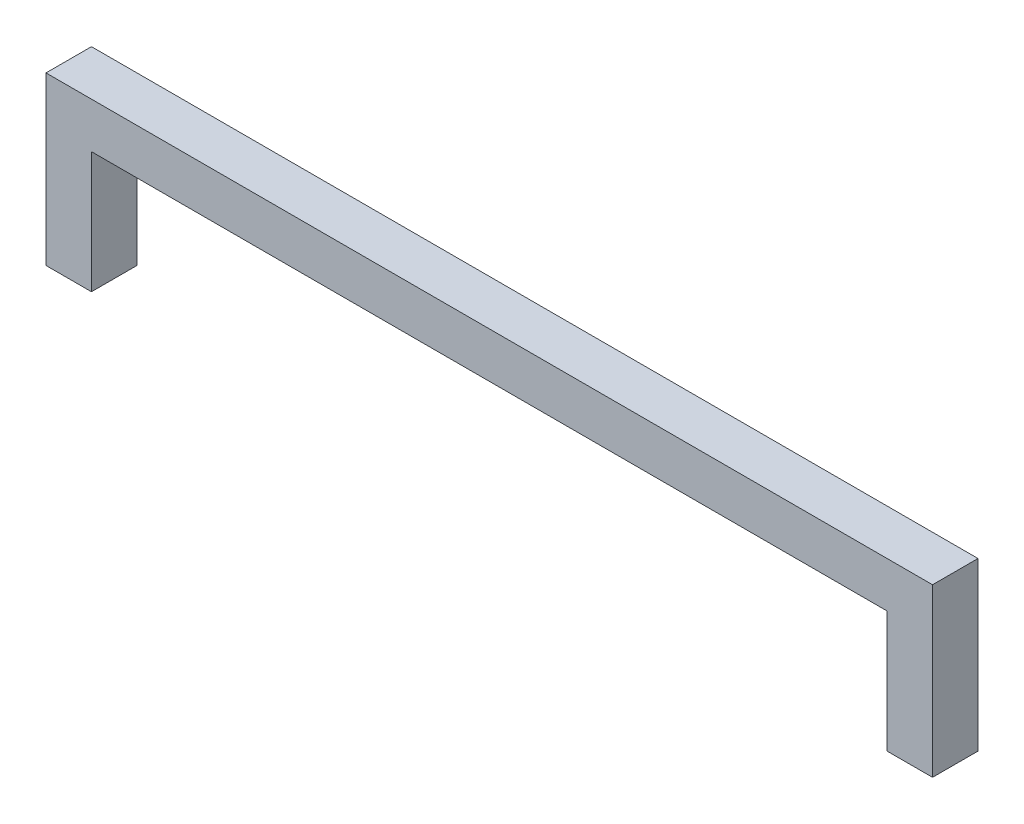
ISO-10303-21;
HEADER;
FILE_DESCRIPTION(('STEP AP214'),'2;1');
FILE_NAME('part.step','',(''),(''),'','','');
FILE_SCHEMA(('AUTOMOTIVE_DESIGN { 1 0 10303 214 1 1 1 1 }'));
ENDSEC;
DATA;
#1=APPLICATION_CONTEXT('core data for automotive mechanical design processes');
#2=APPLICATION_PROTOCOL_DEFINITION('international standard','automotive_design',2000,#1);
#3=PRODUCT_CONTEXT('',#1,'mechanical');
#4=PRODUCT('Part','Part','',(#3));
#5=PRODUCT_RELATED_PRODUCT_CATEGORY('part','',(#4));
#6=PRODUCT_DEFINITION_FORMATION('','',#4);
#7=PRODUCT_DEFINITION_CONTEXT('part definition',#1,'design');
#8=PRODUCT_DEFINITION('design','',#6,#7);
#9=PRODUCT_DEFINITION_SHAPE('','',#8);
#10=(LENGTH_UNIT() NAMED_UNIT(*) SI_UNIT(.MILLI.,.METRE.));
#11=(NAMED_UNIT(*) PLANE_ANGLE_UNIT() SI_UNIT($,.RADIAN.));
#12=(NAMED_UNIT(*) SI_UNIT($,.STERADIAN.) SOLID_ANGLE_UNIT());
#13=UNCERTAINTY_MEASURE_WITH_UNIT(LENGTH_MEASURE(1.E-05),#10,'distance_accuracy_value','');
#14=(GEOMETRIC_REPRESENTATION_CONTEXT(3) GLOBAL_UNCERTAINTY_ASSIGNED_CONTEXT((#13)) GLOBAL_UNIT_ASSIGNED_CONTEXT((#10,
#11,#12)) REPRESENTATION_CONTEXT('',''));
#15=CARTESIAN_POINT('',(0.,0.,0.));
#16=DIRECTION('',(0.,0.,1.));
#17=DIRECTION('',(1.,0.,0.));
#18=AXIS2_PLACEMENT_3D('',#15,#16,#17);
#19=CARTESIAN_POINT('',(700.,0.,0.));
#20=DIRECTION('',(0.,1.,0.));
#21=DIRECTION('',(0.,0.,-1.));
#22=AXIS2_PLACEMENT_3D('',#19,#20,#21);
#23=PLANE('',#22);
#24=DIRECTION('',(0.,0.,-1.));
#25=VECTOR('',#24,1.);
#26=CARTESIAN_POINT('',(700.,0.,0.));
#27=LINE('',#26,#25);
#28=CARTESIAN_POINT('',(700.,0.,40.));
#29=VERTEX_POINT('',#28);
#30=CARTESIAN_POINT('',(700.,0.,0.));
#31=VERTEX_POINT('',#30);
#32=EDGE_CURVE('E260',#29,#31,#27,.T.);
#33=ORIENTED_EDGE('',*,*,#32,.T.);
#34=DIRECTION('',(1.,0.,0.));
#35=VECTOR('',#34,1.);
#36=CARTESIAN_POINT('',(700.,0.,0.));
#37=LINE('',#36,#35);
#38=CARTESIAN_POINT('',(740.,0.,0.));
#39=VERTEX_POINT('',#38);
#40=EDGE_CURVE('E258',#31,#39,#37,.T.);
#41=ORIENTED_EDGE('',*,*,#40,.T.);
#42=DIRECTION('',(0.,0.,1.));
#43=VECTOR('',#42,1.);
#44=CARTESIAN_POINT('',(740.,0.,0.));
#45=LINE('',#44,#43);
#46=CARTESIAN_POINT('',(740.,0.,40.));
#47=VERTEX_POINT('',#46);
#48=EDGE_CURVE('E264',#39,#47,#45,.T.);
#49=ORIENTED_EDGE('',*,*,#48,.T.);
#50=DIRECTION('',(-1.,0.,0.));
#51=VECTOR('',#50,1.);
#52=CARTESIAN_POINT('',(700.,0.,40.));
#53=LINE('',#52,#51);
#54=EDGE_CURVE('E262',#47,#29,#53,.T.);
#55=ORIENTED_EDGE('',*,*,#54,.T.);
#56=EDGE_LOOP('',(#33,#41,#49,#55));
#57=FACE_BOUND('',#56,.T.);
#58=DIRECTION('',(0.,0.,-1.));
#59=VECTOR('',#58,1.);
#60=CARTESIAN_POINT('',(701.,0.,0.));
#61=LINE('',#60,#59);
#62=CARTESIAN_POINT('',(701.,0.,39.));
#63=VERTEX_POINT('',#62);
#64=CARTESIAN_POINT('',(701.,0.,1.));
#65=VERTEX_POINT('',#64);
#66=EDGE_CURVE('E199',#63,#65,#61,.T.);
#67=ORIENTED_EDGE('',*,*,#66,.F.);
#68=DIRECTION('',(-1.,0.,0.));
#69=VECTOR('',#68,1.);
#70=CARTESIAN_POINT('',(700.,0.,39.));
#71=LINE('',#70,#69);
#72=CARTESIAN_POINT('',(739.,0.,39.));
#73=VERTEX_POINT('',#72);
#74=EDGE_CURVE('E197',#73,#63,#71,.T.);
#75=ORIENTED_EDGE('',*,*,#74,.F.);
#76=DIRECTION('',(0.,0.,1.));
#77=VECTOR('',#76,1.);
#78=CARTESIAN_POINT('',(739.,0.,0.));
#79=LINE('',#78,#77);
#80=CARTESIAN_POINT('',(739.,0.,1.));
#81=VERTEX_POINT('',#80);
#82=EDGE_CURVE('E167',#81,#73,#79,.T.);
#83=ORIENTED_EDGE('',*,*,#82,.F.);
#84=DIRECTION('',(1.,0.,0.));
#85=VECTOR('',#84,1.);
#86=CARTESIAN_POINT('',(700.,0.,1.));
#87=LINE('',#86,#85);
#88=EDGE_CURVE('E201',#65,#81,#87,.T.);
#89=ORIENTED_EDGE('',*,*,#88,.F.);
#90=EDGE_LOOP('',(#67,#75,#83,#89));
#91=FACE_BOUND('',#90,.T.);
#92=ADVANCED_FACE('F39',(#57,#91),#23,.F.);
#93=CARTESIAN_POINT('',(0.,0.,0.));
#94=DIRECTION('',(0.,-1.,0.));
#95=DIRECTION('',(0.,0.,-1.));
#96=AXIS2_PLACEMENT_3D('',#93,#94,#95);
#97=PLANE('',#96);
#98=DIRECTION('',(0.,0.,-1.));
#99=VECTOR('',#98,1.);
#100=CARTESIAN_POINT('',(0.,0.,0.));
#101=LINE('',#100,#99);
#102=CARTESIAN_POINT('',(0.,0.,40.));
#103=VERTEX_POINT('',#102);
#104=CARTESIAN_POINT('',(0.,0.,0.));
#105=VERTEX_POINT('',#104);
#106=EDGE_CURVE('E229',#103,#105,#101,.T.);
#107=ORIENTED_EDGE('',*,*,#106,.F.);
#108=DIRECTION('',(1.,0.,0.));
#109=VECTOR('',#108,1.);
#110=CARTESIAN_POINT('',(0.,0.,40.));
#111=LINE('',#110,#109);
#112=CARTESIAN_POINT('',(-40.,0.,40.));
#113=VERTEX_POINT('',#112);
#114=EDGE_CURVE('E217',#113,#103,#111,.T.);
#115=ORIENTED_EDGE('',*,*,#114,.F.);
#116=DIRECTION('',(0.,0.,1.));
#117=VECTOR('',#116,1.);
#118=CARTESIAN_POINT('',(-40.,0.,0.));
#119=LINE('',#118,#117);
#120=CARTESIAN_POINT('',(-40.,0.,0.));
#121=VERTEX_POINT('',#120);
#122=EDGE_CURVE('E214',#121,#113,#119,.T.);
#123=ORIENTED_EDGE('',*,*,#122,.F.);
#124=DIRECTION('',(-1.,0.,0.));
#125=VECTOR('',#124,1.);
#126=CARTESIAN_POINT('',(0.,0.,0.));
#127=LINE('',#126,#125);
#128=EDGE_CURVE('E226',#105,#121,#127,.T.);
#129=ORIENTED_EDGE('',*,*,#128,.F.);
#130=EDGE_LOOP('',(#107,#115,#123,#129));
#131=FACE_BOUND('',#130,.T.);
#132=DIRECTION('',(1.,0.,0.));
#133=VECTOR('',#132,1.);
#134=CARTESIAN_POINT('',(0.,0.,39.));
#135=LINE('',#134,#133);
#136=CARTESIAN_POINT('',(-39.,0.,39.));
#137=VERTEX_POINT('',#136);
#138=CARTESIAN_POINT('',(-1.,0.,39.));
#139=VERTEX_POINT('',#138);
#140=EDGE_CURVE('E208',#137,#139,#135,.T.);
#141=ORIENTED_EDGE('',*,*,#140,.T.);
#142=DIRECTION('',(0.,0.,-1.));
#143=VECTOR('',#142,1.);
#144=CARTESIAN_POINT('',(-1.,0.,0.));
#145=LINE('',#144,#143);
#146=CARTESIAN_POINT('',(-1.,0.,1.));
#147=VERTEX_POINT('',#146);
#148=EDGE_CURVE('E205',#139,#147,#145,.T.);
#149=ORIENTED_EDGE('',*,*,#148,.T.);
#150=DIRECTION('',(-1.,0.,0.));
#151=VECTOR('',#150,1.);
#152=CARTESIAN_POINT('',(0.,0.,1.));
#153=LINE('',#152,#151);
#154=CARTESIAN_POINT('',(-39.,0.,1.));
#155=VERTEX_POINT('',#154);
#156=EDGE_CURVE('E188',#147,#155,#153,.T.);
#157=ORIENTED_EDGE('',*,*,#156,.T.);
#158=DIRECTION('',(0.,0.,1.));
#159=VECTOR('',#158,1.);
#160=CARTESIAN_POINT('',(-39.,0.,0.));
#161=LINE('',#160,#159);
#162=EDGE_CURVE('E211',#155,#137,#161,.T.);
#163=ORIENTED_EDGE('',*,*,#162,.T.);
#164=EDGE_LOOP('',(#141,#149,#157,#163));
#165=FACE_BOUND('',#164,.T.);
#166=ADVANCED_FACE('F293',(#131,#165),#97,.T.);
#167=CARTESIAN_POINT('',(740.,150.87,0.));
#168=DIRECTION('',(1.,0.,0.));
#169=DIRECTION('',(0.,0.,-1.));
#170=AXIS2_PLACEMENT_3D('',#167,#168,#169);
#171=PLANE('',#170);
#172=DIRECTION('',(0.,0.,-1.));
#173=VECTOR('',#172,1.);
#174=CARTESIAN_POINT('',(740.,146.77,-1.31427935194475E-13));
#175=LINE('',#174,#173);
#176=CARTESIAN_POINT('',(740.,146.77,40.));
#177=VERTEX_POINT('',#176);
#178=CARTESIAN_POINT('',(740.,146.77,0.));
#179=VERTEX_POINT('',#178);
#180=EDGE_CURVE('E243',#177,#179,#175,.T.);
#181=ORIENTED_EDGE('',*,*,#180,.F.);
#182=DIRECTION('',(0.,-1.,0.));
#183=VECTOR('',#182,1.);
#184=CARTESIAN_POINT('',(740.,150.87,40.));
#185=LINE('',#184,#183);
#186=EDGE_CURVE('E271',#177,#47,#185,.T.);
#187=ORIENTED_EDGE('',*,*,#186,.T.);
#188=ORIENTED_EDGE('',*,*,#48,.F.);
#189=DIRECTION('',(0.,-1.,0.));
#190=VECTOR('',#189,1.);
#191=CARTESIAN_POINT('',(740.,150.87,0.));
#192=LINE('',#191,#190);
#193=EDGE_CURVE('E42',#179,#39,#192,.T.);
#194=ORIENTED_EDGE('',*,*,#193,.F.);
#195=EDGE_LOOP('',(#181,#187,#188,#194));
#196=FACE_BOUND('',#195,.T.);
#197=ADVANCED_FACE('F281',(#196),#171,.T.);
#198=CARTESIAN_POINT('',(700.,150.87,0.));
#199=DIRECTION('',(-1.,0.,0.));
#200=DIRECTION('',(0.,0.,1.));
#201=AXIS2_PLACEMENT_3D('',#198,#199,#200);
#202=PLANE('',#201);
#203=DIRECTION('',(0.,0.,1.));
#204=VECTOR('',#203,1.);
#205=CARTESIAN_POINT('',(700.,106.77,0.));
#206=LINE('',#205,#204);
#207=CARTESIAN_POINT('',(700.,106.77,0.));
#208=VERTEX_POINT('',#207);
#209=CARTESIAN_POINT('',(700.,106.77,40.));
#210=VERTEX_POINT('',#209);
#211=EDGE_CURVE('E218',#208,#210,#206,.T.);
#212=ORIENTED_EDGE('',*,*,#211,.F.);
#213=DIRECTION('',(0.,-1.,0.));
#214=VECTOR('',#213,1.);
#215=CARTESIAN_POINT('',(700.,150.87,0.));
#216=LINE('',#215,#214);
#217=EDGE_CURVE('E266',#208,#31,#216,.T.);
#218=ORIENTED_EDGE('',*,*,#217,.T.);
#219=ORIENTED_EDGE('',*,*,#32,.F.);
#220=DIRECTION('',(0.,-1.,0.));
#221=VECTOR('',#220,1.);
#222=CARTESIAN_POINT('',(700.,150.87,40.));
#223=LINE('',#222,#221);
#224=EDGE_CURVE('E269',#210,#29,#223,.T.);
#225=ORIENTED_EDGE('',*,*,#224,.F.);
#226=EDGE_LOOP('',(#212,#218,#219,#225));
#227=FACE_BOUND('',#226,.T.);
#228=ADVANCED_FACE('F303',(#227),#202,.T.);
#229=CARTESIAN_POINT('',(-44.1,106.77,0.));
#230=DIRECTION('',(0.,-1.,0.));
#231=DIRECTION('',(0.,0.,-1.));
#232=AXIS2_PLACEMENT_3D('',#229,#230,#231);
#233=PLANE('',#232);
#234=DIRECTION('',(1.,0.,0.));
#235=VECTOR('',#234,1.);
#236=CARTESIAN_POINT('',(-44.1,106.77,0.));
#237=LINE('',#236,#235);
#238=CARTESIAN_POINT('',(0.,106.77,0.));
#239=VERTEX_POINT('',#238);
#240=EDGE_CURVE('E244',#239,#208,#237,.T.);
#241=ORIENTED_EDGE('',*,*,#240,.T.);
#242=ORIENTED_EDGE('',*,*,#211,.T.);
#243=DIRECTION('',(1.,0.,0.));
#244=VECTOR('',#243,1.);
#245=CARTESIAN_POINT('',(-44.1,106.77,40.));
#246=LINE('',#245,#244);
#247=CARTESIAN_POINT('',(0.,106.77,40.));
#248=VERTEX_POINT('',#247);
#249=EDGE_CURVE('E247',#248,#210,#246,.T.);
#250=ORIENTED_EDGE('',*,*,#249,.F.);
#251=DIRECTION('',(0.,0.,1.));
#252=VECTOR('',#251,1.);
#253=CARTESIAN_POINT('',(0.,106.77,0.));
#254=LINE('',#253,#252);
#255=EDGE_CURVE('E11',#239,#248,#254,.T.);
#256=ORIENTED_EDGE('',*,*,#255,.F.);
#257=EDGE_LOOP('',(#241,#242,#250,#256));
#258=FACE_BOUND('',#257,.T.);
#259=ADVANCED_FACE('F301',(#258),#233,.T.);
#260=CARTESIAN_POINT('',(-44.1,146.77,0.));
#261=DIRECTION('',(0.,1.,0.));
#262=DIRECTION('',(0.,0.,1.));
#263=AXIS2_PLACEMENT_3D('',#260,#261,#262);
#264=PLANE('',#263);
#265=DIRECTION('',(1.,0.,0.));
#266=VECTOR('',#265,1.);
#267=CARTESIAN_POINT('',(-44.1,146.77,40.));
#268=LINE('',#267,#266);
#269=CARTESIAN_POINT('',(-40.,146.77,40.));
#270=VERTEX_POINT('',#269);
#271=EDGE_CURVE('E250',#270,#177,#268,.T.);
#272=ORIENTED_EDGE('',*,*,#271,.T.);
#273=ORIENTED_EDGE('',*,*,#180,.T.);
#274=DIRECTION('',(1.,0.,0.));
#275=VECTOR('',#274,1.);
#276=CARTESIAN_POINT('',(-44.1,146.77,0.));
#277=LINE('',#276,#275);
#278=CARTESIAN_POINT('',(-40.,146.77,0.));
#279=VERTEX_POINT('',#278);
#280=EDGE_CURVE('E253',#279,#179,#277,.T.);
#281=ORIENTED_EDGE('',*,*,#280,.F.);
#282=DIRECTION('',(0.,0.,-1.));
#283=VECTOR('',#282,1.);
#284=CARTESIAN_POINT('',(-40.,146.77,0.));
#285=LINE('',#284,#283);
#286=EDGE_CURVE('E47',#270,#279,#285,.T.);
#287=ORIENTED_EDGE('',*,*,#286,.F.);
#288=EDGE_LOOP('',(#272,#273,#281,#287));
#289=FACE_BOUND('',#288,.T.);
#290=ADVANCED_FACE('F283',(#289),#264,.T.);
#291=CARTESIAN_POINT('',(0.,0.,0.));
#292=DIRECTION('',(0.,0.,-1.));
#293=DIRECTION('',(-1.,0.,0.));
#294=AXIS2_PLACEMENT_3D('',#291,#292,#293);
#295=PLANE('',#294);
#296=DIRECTION('',(0.,1.,0.));
#297=VECTOR('',#296,1.);
#298=CARTESIAN_POINT('',(-40.,0.,0.));
#299=LINE('',#298,#297);
#300=EDGE_CURVE('E223',#121,#279,#299,.T.);
#301=ORIENTED_EDGE('',*,*,#300,.T.);
#302=ORIENTED_EDGE('',*,*,#280,.T.);
#303=ORIENTED_EDGE('',*,*,#193,.T.);
#304=ORIENTED_EDGE('',*,*,#40,.F.);
#305=ORIENTED_EDGE('',*,*,#217,.F.);
#306=ORIENTED_EDGE('',*,*,#240,.F.);
#307=DIRECTION('',(0.,1.,0.));
#308=VECTOR('',#307,1.);
#309=CARTESIAN_POINT('',(0.,0.,0.));
#310=LINE('',#309,#308);
#311=EDGE_CURVE('E232',#105,#239,#310,.T.);
#312=ORIENTED_EDGE('',*,*,#311,.F.);
#313=ORIENTED_EDGE('',*,*,#128,.T.);
#314=EDGE_LOOP('',(#301,#302,#303,#304,#305,#306,#312,#313));
#315=FACE_BOUND('',#314,.T.);
#316=ADVANCED_FACE('F279',(#315),#295,.T.);
#317=CARTESIAN_POINT('',(0.,0.,0.));
#318=DIRECTION('',(1.,0.,0.));
#319=DIRECTION('',(0.,0.,-1.));
#320=AXIS2_PLACEMENT_3D('',#317,#318,#319);
#321=PLANE('',#320);
#322=ORIENTED_EDGE('',*,*,#311,.T.);
#323=ORIENTED_EDGE('',*,*,#255,.T.);
#324=DIRECTION('',(0.,1.,0.));
#325=VECTOR('',#324,1.);
#326=CARTESIAN_POINT('',(0.,0.,40.));
#327=LINE('',#326,#325);
#328=EDGE_CURVE('E222',#103,#248,#327,.T.);
#329=ORIENTED_EDGE('',*,*,#328,.F.);
#330=ORIENTED_EDGE('',*,*,#106,.T.);
#331=EDGE_LOOP('',(#322,#323,#329,#330));
#332=FACE_BOUND('',#331,.T.);
#333=ADVANCED_FACE('F298',(#332),#321,.T.);
#334=CARTESIAN_POINT('',(0.,0.,40.));
#335=DIRECTION('',(0.,0.,1.));
#336=DIRECTION('',(1.,0.,0.));
#337=AXIS2_PLACEMENT_3D('',#334,#335,#336);
#338=PLANE('',#337);
#339=ORIENTED_EDGE('',*,*,#328,.T.);
#340=ORIENTED_EDGE('',*,*,#249,.T.);
#341=ORIENTED_EDGE('',*,*,#224,.T.);
#342=ORIENTED_EDGE('',*,*,#54,.F.);
#343=ORIENTED_EDGE('',*,*,#186,.F.);
#344=ORIENTED_EDGE('',*,*,#271,.F.);
#345=DIRECTION('',(0.,1.,0.));
#346=VECTOR('',#345,1.);
#347=CARTESIAN_POINT('',(-40.,0.,40.));
#348=LINE('',#347,#346);
#349=EDGE_CURVE('E219',#113,#270,#348,.T.);
#350=ORIENTED_EDGE('',*,*,#349,.F.);
#351=ORIENTED_EDGE('',*,*,#114,.T.);
#352=EDGE_LOOP('',(#339,#340,#341,#342,#343,#344,#350,#351));
#353=FACE_BOUND('',#352,.T.);
#354=ADVANCED_FACE('F287',(#353),#338,.T.);
#355=CARTESIAN_POINT('',(-40.,0.,0.));
#356=DIRECTION('',(-1.,0.,0.));
#357=DIRECTION('',(0.,0.,1.));
#358=AXIS2_PLACEMENT_3D('',#355,#356,#357);
#359=PLANE('',#358);
#360=ORIENTED_EDGE('',*,*,#349,.T.);
#361=ORIENTED_EDGE('',*,*,#286,.T.);
#362=ORIENTED_EDGE('',*,*,#300,.F.);
#363=ORIENTED_EDGE('',*,*,#122,.T.);
#364=EDGE_LOOP('',(#360,#361,#362,#363));
#365=FACE_BOUND('',#364,.T.);
#366=ADVANCED_FACE('F290',(#365),#359,.T.);
#367=CARTESIAN_POINT('',(739.,150.87,0.));
#368=DIRECTION('',(1.,0.,0.));
#369=DIRECTION('',(0.,0.,-1.));
#370=AXIS2_PLACEMENT_3D('',#367,#368,#369);
#371=PLANE('',#370);
#372=DIRECTION('',(0.,0.,-1.));
#373=VECTOR('',#372,1.);
#374=CARTESIAN_POINT('',(739.,145.77,-1.3108099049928E-13));
#375=LINE('',#374,#373);
#376=CARTESIAN_POINT('',(739.,145.77,39.));
#377=VERTEX_POINT('',#376);
#378=CARTESIAN_POINT('',(739.,145.77,1.));
#379=VERTEX_POINT('',#378);
#380=EDGE_CURVE('E155',#377,#379,#375,.T.);
#381=ORIENTED_EDGE('',*,*,#380,.T.);
#382=DIRECTION('',(0.,-1.,0.));
#383=VECTOR('',#382,1.);
#384=CARTESIAN_POINT('',(739.,150.87,1.));
#385=LINE('',#384,#383);
#386=EDGE_CURVE('E169',#379,#81,#385,.T.);
#387=ORIENTED_EDGE('',*,*,#386,.T.);
#388=ORIENTED_EDGE('',*,*,#82,.T.);
#389=DIRECTION('',(0.,-1.,0.));
#390=VECTOR('',#389,1.);
#391=CARTESIAN_POINT('',(739.,150.87,39.));
#392=LINE('',#391,#390);
#393=EDGE_CURVE('E55',#377,#73,#392,.T.);
#394=ORIENTED_EDGE('',*,*,#393,.F.);
#395=EDGE_LOOP('',(#381,#387,#388,#394));
#396=FACE_BOUND('',#395,.T.);
#397=ADVANCED_FACE('F165',(#396),#371,.F.);
#398=CARTESIAN_POINT('',(700.,150.87,39.));
#399=DIRECTION('',(0.,0.,1.));
#400=DIRECTION('',(1.,0.,0.));
#401=AXIS2_PLACEMENT_3D('',#398,#399,#400);
#402=PLANE('',#401);
#403=DIRECTION('',(0.,-1.,0.));
#404=VECTOR('',#403,1.);
#405=CARTESIAN_POINT('',(701.,150.87,39.));
#406=LINE('',#405,#404);
#407=CARTESIAN_POINT('',(701.,107.77,39.));
#408=VERTEX_POINT('',#407);
#409=EDGE_CURVE('E170',#408,#63,#406,.T.);
#410=ORIENTED_EDGE('',*,*,#409,.F.);
#411=DIRECTION('',(1.,0.,0.));
#412=VECTOR('',#411,1.);
#413=CARTESIAN_POINT('',(-44.1,107.77,39.));
#414=LINE('',#413,#412);
#415=CARTESIAN_POINT('',(-0.999999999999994,107.77,39.));
#416=VERTEX_POINT('',#415);
#417=EDGE_CURVE('E175',#416,#408,#414,.T.);
#418=ORIENTED_EDGE('',*,*,#417,.F.);
#419=DIRECTION('',(0.,1.,0.));
#420=VECTOR('',#419,1.);
#421=CARTESIAN_POINT('',(-1.,0.,39.));
#422=LINE('',#421,#420);
#423=EDGE_CURVE('E191',#139,#416,#422,.T.);
#424=ORIENTED_EDGE('',*,*,#423,.F.);
#425=ORIENTED_EDGE('',*,*,#140,.F.);
#426=DIRECTION('',(0.,1.,0.));
#427=VECTOR('',#426,1.);
#428=CARTESIAN_POINT('',(-39.,0.,39.));
#429=LINE('',#428,#427);
#430=CARTESIAN_POINT('',(-39.,145.77,39.));
#431=VERTEX_POINT('',#430);
#432=EDGE_CURVE('E174',#137,#431,#429,.T.);
#433=ORIENTED_EDGE('',*,*,#432,.T.);
#434=DIRECTION('',(1.,0.,0.));
#435=VECTOR('',#434,1.);
#436=CARTESIAN_POINT('',(-44.1,145.77,39.));
#437=LINE('',#436,#435);
#438=EDGE_CURVE('E158',#431,#377,#437,.T.);
#439=ORIENTED_EDGE('',*,*,#438,.T.);
#440=ORIENTED_EDGE('',*,*,#393,.T.);
#441=ORIENTED_EDGE('',*,*,#74,.T.);
#442=EDGE_LOOP('',(#410,#418,#424,#425,#433,#439,#440,#441));
#443=FACE_BOUND('',#442,.T.);
#444=ADVANCED_FACE('F172',(#443),#402,.F.);
#445=CARTESIAN_POINT('',(701.,150.87,0.));
#446=DIRECTION('',(-1.,0.,0.));
#447=DIRECTION('',(0.,0.,1.));
#448=AXIS2_PLACEMENT_3D('',#445,#446,#447);
#449=PLANE('',#448);
#450=DIRECTION('',(0.,0.,1.));
#451=VECTOR('',#450,1.);
#452=CARTESIAN_POINT('',(701.,107.77,0.));
#453=LINE('',#452,#451);
#454=CARTESIAN_POINT('',(701.,107.77,1.));
#455=VERTEX_POINT('',#454);
#456=EDGE_CURVE('E163',#455,#408,#453,.T.);
#457=ORIENTED_EDGE('',*,*,#456,.T.);
#458=ORIENTED_EDGE('',*,*,#409,.T.);
#459=ORIENTED_EDGE('',*,*,#66,.T.);
#460=DIRECTION('',(0.,-1.,0.));
#461=VECTOR('',#460,1.);
#462=CARTESIAN_POINT('',(701.,150.87,1.));
#463=LINE('',#462,#461);
#464=EDGE_CURVE('E196',#455,#65,#463,.T.);
#465=ORIENTED_EDGE('',*,*,#464,.F.);
#466=EDGE_LOOP('',(#457,#458,#459,#465));
#467=FACE_BOUND('',#466,.T.);
#468=ADVANCED_FACE('F315',(#467),#449,.F.);
#469=CARTESIAN_POINT('',(700.,150.87,1.));
#470=DIRECTION('',(0.,0.,-1.));
#471=DIRECTION('',(-1.,0.,0.));
#472=AXIS2_PLACEMENT_3D('',#469,#470,#471);
#473=PLANE('',#472);
#474=ORIENTED_EDGE('',*,*,#386,.F.);
#475=DIRECTION('',(1.,0.,0.));
#476=VECTOR('',#475,1.);
#477=CARTESIAN_POINT('',(-44.1,145.77,1.));
#478=LINE('',#477,#476);
#479=CARTESIAN_POINT('',(-39.,145.77,1.));
#480=VERTEX_POINT('',#479);
#481=EDGE_CURVE('E160',#480,#379,#478,.T.);
#482=ORIENTED_EDGE('',*,*,#481,.F.);
#483=DIRECTION('',(0.,1.,0.));
#484=VECTOR('',#483,1.);
#485=CARTESIAN_POINT('',(-39.,0.,1.));
#486=LINE('',#485,#484);
#487=EDGE_CURVE('E63',#155,#480,#486,.T.);
#488=ORIENTED_EDGE('',*,*,#487,.F.);
#489=ORIENTED_EDGE('',*,*,#156,.F.);
#490=DIRECTION('',(0.,1.,0.));
#491=VECTOR('',#490,1.);
#492=CARTESIAN_POINT('',(-1.,0.,1.));
#493=LINE('',#492,#491);
#494=CARTESIAN_POINT('',(-0.999999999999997,107.77,1.));
#495=VERTEX_POINT('',#494);
#496=EDGE_CURVE('E186',#147,#495,#493,.T.);
#497=ORIENTED_EDGE('',*,*,#496,.T.);
#498=DIRECTION('',(1.,0.,0.));
#499=VECTOR('',#498,1.);
#500=CARTESIAN_POINT('',(-44.1,107.77,1.));
#501=LINE('',#500,#499);
#502=EDGE_CURVE('E179',#495,#455,#501,.T.);
#503=ORIENTED_EDGE('',*,*,#502,.T.);
#504=ORIENTED_EDGE('',*,*,#464,.T.);
#505=ORIENTED_EDGE('',*,*,#88,.T.);
#506=EDGE_LOOP('',(#474,#482,#488,#489,#497,#503,#504,#505));
#507=FACE_BOUND('',#506,.T.);
#508=ADVANCED_FACE('F317',(#507),#473,.F.);
#509=CARTESIAN_POINT('',(-44.1,107.77,0.));
#510=DIRECTION('',(0.,-1.,0.));
#511=DIRECTION('',(0.,0.,-1.));
#512=AXIS2_PLACEMENT_3D('',#509,#510,#511);
#513=PLANE('',#512);
#514=ORIENTED_EDGE('',*,*,#502,.F.);
#515=DIRECTION('',(0.,0.,1.));
#516=VECTOR('',#515,1.);
#517=CARTESIAN_POINT('',(-1.,107.77,0.));
#518=LINE('',#517,#516);
#519=EDGE_CURVE('E183',#495,#416,#518,.T.);
#520=ORIENTED_EDGE('',*,*,#519,.T.);
#521=ORIENTED_EDGE('',*,*,#417,.T.);
#522=ORIENTED_EDGE('',*,*,#456,.F.);
#523=EDGE_LOOP('',(#514,#520,#521,#522));
#524=FACE_BOUND('',#523,.T.);
#525=ADVANCED_FACE('F332',(#524),#513,.F.);
#526=CARTESIAN_POINT('',(-44.1,145.77,0.));
#527=DIRECTION('',(0.,1.,0.));
#528=DIRECTION('',(0.,0.,1.));
#529=AXIS2_PLACEMENT_3D('',#526,#527,#528);
#530=PLANE('',#529);
#531=ORIENTED_EDGE('',*,*,#438,.F.);
#532=DIRECTION('',(0.,0.,-1.));
#533=VECTOR('',#532,1.);
#534=CARTESIAN_POINT('',(-39.,145.77,0.));
#535=LINE('',#534,#533);
#536=EDGE_CURVE('E184',#431,#480,#535,.T.);
#537=ORIENTED_EDGE('',*,*,#536,.T.);
#538=ORIENTED_EDGE('',*,*,#481,.T.);
#539=ORIENTED_EDGE('',*,*,#380,.F.);
#540=EDGE_LOOP('',(#531,#537,#538,#539));
#541=FACE_BOUND('',#540,.T.);
#542=ADVANCED_FACE('F156',(#541),#530,.F.);
#543=CARTESIAN_POINT('',(-1.,0.,0.));
#544=DIRECTION('',(1.,0.,0.));
#545=DIRECTION('',(0.,0.,-1.));
#546=AXIS2_PLACEMENT_3D('',#543,#544,#545);
#547=PLANE('',#546);
#548=ORIENTED_EDGE('',*,*,#496,.F.);
#549=ORIENTED_EDGE('',*,*,#148,.F.);
#550=ORIENTED_EDGE('',*,*,#423,.T.);
#551=ORIENTED_EDGE('',*,*,#519,.F.);
#552=EDGE_LOOP('',(#548,#549,#550,#551));
#553=FACE_BOUND('',#552,.T.);
#554=ADVANCED_FACE('F328',(#553),#547,.F.);
#555=CARTESIAN_POINT('',(-39.,0.,0.));
#556=DIRECTION('',(-1.,0.,0.));
#557=DIRECTION('',(0.,0.,1.));
#558=AXIS2_PLACEMENT_3D('',#555,#556,#557);
#559=PLANE('',#558);
#560=ORIENTED_EDGE('',*,*,#432,.F.);
#561=ORIENTED_EDGE('',*,*,#162,.F.);
#562=ORIENTED_EDGE('',*,*,#487,.T.);
#563=ORIENTED_EDGE('',*,*,#536,.F.);
#564=EDGE_LOOP('',(#560,#561,#562,#563));
#565=FACE_BOUND('',#564,.T.);
#566=ADVANCED_FACE('F325',(#565),#559,.F.);
#567=CLOSED_SHELL('',(#92,#166,#197,#228,#259,#290,#316,#333,#354,#366,#397,#444,#468,#508,#525,
#542,#554,#566));
#568=MANIFOLD_SOLID_BREP('B2',#567);
#569=ADVANCED_BREP_SHAPE_REPRESENTATION('',(#18,#568),#14);
#570=SHAPE_DEFINITION_REPRESENTATION(#9,#569);
ENDSEC;
END-ISO-10303-21;
